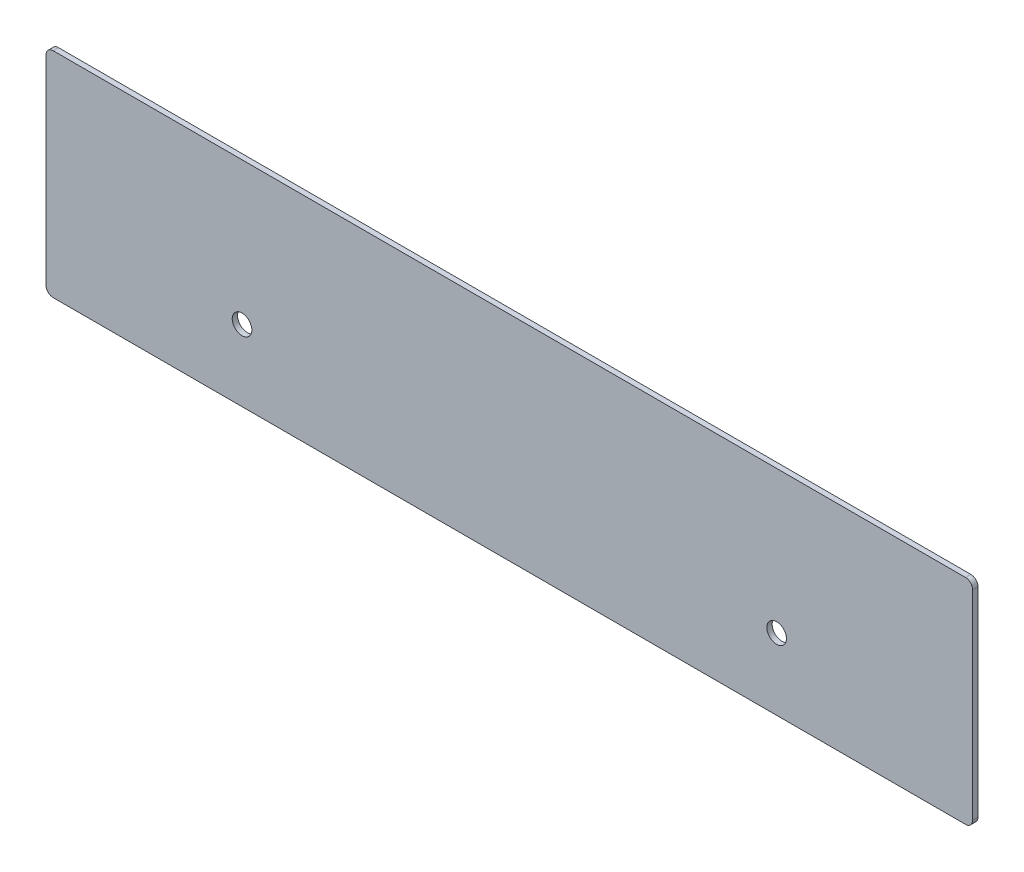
ISO-10303-21;
HEADER;
FILE_DESCRIPTION(('STEP AP214'),'2;1');
FILE_NAME('part.step','',(''),(''),'','','');
FILE_SCHEMA(('AUTOMOTIVE_DESIGN { 1 0 10303 214 1 1 1 1 }'));
ENDSEC;
DATA;
#1=APPLICATION_CONTEXT('core data for automotive mechanical design processes');
#2=APPLICATION_PROTOCOL_DEFINITION('international standard','automotive_design',2000,#1);
#3=PRODUCT_CONTEXT('',#1,'mechanical');
#4=PRODUCT('Part','Part','',(#3));
#5=PRODUCT_RELATED_PRODUCT_CATEGORY('part','',(#4));
#6=PRODUCT_DEFINITION_FORMATION('','',#4);
#7=PRODUCT_DEFINITION_CONTEXT('part definition',#1,'design');
#8=PRODUCT_DEFINITION('design','',#6,#7);
#9=PRODUCT_DEFINITION_SHAPE('','',#8);
#10=(LENGTH_UNIT() NAMED_UNIT(*) SI_UNIT(.MILLI.,.METRE.));
#11=(NAMED_UNIT(*) PLANE_ANGLE_UNIT() SI_UNIT($,.RADIAN.));
#12=(NAMED_UNIT(*) SI_UNIT($,.STERADIAN.) SOLID_ANGLE_UNIT());
#13=UNCERTAINTY_MEASURE_WITH_UNIT(LENGTH_MEASURE(1.E-05),#10,'distance_accuracy_value','');
#14=(GEOMETRIC_REPRESENTATION_CONTEXT(3) GLOBAL_UNCERTAINTY_ASSIGNED_CONTEXT((#13)) GLOBAL_UNIT_ASSIGNED_CONTEXT((#10,
#11,#12)) REPRESENTATION_CONTEXT('',''));
#15=CARTESIAN_POINT('',(0.,0.,0.));
#16=DIRECTION('',(0.,0.,1.));
#17=DIRECTION('',(1.,0.,0.));
#18=AXIS2_PLACEMENT_3D('',#15,#16,#17);
#19=CARTESIAN_POINT('',(130.,-30.,1.5));
#20=DIRECTION('',(-1.,0.,0.));
#21=DIRECTION('',(0.,0.,1.));
#22=AXIS2_PLACEMENT_3D('',#19,#20,#21);
#23=PLANE('',#22);
#24=DIRECTION('',(0.,1.,0.));
#25=VECTOR('',#24,1.);
#26=CARTESIAN_POINT('',(130.,-30.,1.5));
#27=LINE('',#26,#25);
#28=CARTESIAN_POINT('',(130.,-28.,1.5));
#29=VERTEX_POINT('',#28);
#30=CARTESIAN_POINT('',(130.,28.,1.5));
#31=VERTEX_POINT('',#30);
#32=EDGE_CURVE('E126',#29,#31,#27,.T.);
#33=ORIENTED_EDGE('',*,*,#32,.F.);
#34=DIRECTION('',(0.,0.,-1.));
#35=VECTOR('',#34,1.);
#36=CARTESIAN_POINT('',(130.,-28.,1.5));
#37=LINE('',#36,#35);
#38=CARTESIAN_POINT('',(130.,-28.,0.));
#39=VERTEX_POINT('',#38);
#40=EDGE_CURVE('E152',#29,#39,#37,.T.);
#41=ORIENTED_EDGE('',*,*,#40,.T.);
#42=DIRECTION('',(0.,1.,0.));
#43=VECTOR('',#42,1.);
#44=CARTESIAN_POINT('',(130.,-30.,0.));
#45=LINE('',#44,#43);
#46=CARTESIAN_POINT('',(130.,28.,0.));
#47=VERTEX_POINT('',#46);
#48=EDGE_CURVE('E158',#39,#47,#45,.T.);
#49=ORIENTED_EDGE('',*,*,#48,.T.);
#50=DIRECTION('',(0.,0.,-1.));
#51=VECTOR('',#50,1.);
#52=CARTESIAN_POINT('',(130.,28.,1.5));
#53=LINE('',#52,#51);
#54=EDGE_CURVE('E150',#47,#31,#53,.F.);
#55=ORIENTED_EDGE('',*,*,#54,.T.);
#56=EDGE_LOOP('',(#33,#41,#49,#55));
#57=FACE_BOUND('',#56,.T.);
#58=ADVANCED_FACE('F34',(#57),#23,.F.);
#59=CARTESIAN_POINT('',(-130.,30.,1.5));
#60=DIRECTION('',(0.,-1.,0.));
#61=DIRECTION('',(0.,0.,-1.));
#62=AXIS2_PLACEMENT_3D('',#59,#60,#61);
#63=PLANE('',#62);
#64=DIRECTION('',(-1.,0.,0.));
#65=VECTOR('',#64,1.);
#66=CARTESIAN_POINT('',(-130.,30.,1.5));
#67=LINE('',#66,#65);
#68=CARTESIAN_POINT('',(128.,30.,1.5));
#69=VERTEX_POINT('',#68);
#70=CARTESIAN_POINT('',(-128.,30.,1.5));
#71=VERTEX_POINT('',#70);
#72=EDGE_CURVE('E129',#69,#71,#67,.T.);
#73=ORIENTED_EDGE('',*,*,#72,.F.);
#74=DIRECTION('',(0.,0.,-1.));
#75=VECTOR('',#74,1.);
#76=CARTESIAN_POINT('',(128.,30.,1.5));
#77=LINE('',#76,#75);
#78=CARTESIAN_POINT('',(128.,30.,0.));
#79=VERTEX_POINT('',#78);
#80=EDGE_CURVE('E11',#69,#79,#77,.T.);
#81=ORIENTED_EDGE('',*,*,#80,.T.);
#82=DIRECTION('',(-1.,0.,0.));
#83=VECTOR('',#82,1.);
#84=CARTESIAN_POINT('',(-130.,30.,0.));
#85=LINE('',#84,#83);
#86=CARTESIAN_POINT('',(-128.,30.,0.));
#87=VERTEX_POINT('',#86);
#88=EDGE_CURVE('E131',#79,#87,#85,.T.);
#89=ORIENTED_EDGE('',*,*,#88,.T.);
#90=DIRECTION('',(0.,0.,-1.));
#91=VECTOR('',#90,1.);
#92=CARTESIAN_POINT('',(-128.,30.,1.5));
#93=LINE('',#92,#91);
#94=EDGE_CURVE('E42',#87,#71,#93,.F.);
#95=ORIENTED_EDGE('',*,*,#94,.T.);
#96=EDGE_LOOP('',(#73,#81,#89,#95));
#97=FACE_BOUND('',#96,.T.);
#98=ADVANCED_FACE('F203',(#97),#63,.F.);
#99=CARTESIAN_POINT('',(-130.,-30.,1.5));
#100=DIRECTION('',(1.,0.,0.));
#101=DIRECTION('',(0.,0.,-1.));
#102=AXIS2_PLACEMENT_3D('',#99,#100,#101);
#103=PLANE('',#102);
#104=DIRECTION('',(0.,-1.,0.));
#105=VECTOR('',#104,1.);
#106=CARTESIAN_POINT('',(-130.,-30.,0.));
#107=LINE('',#106,#105);
#108=CARTESIAN_POINT('',(-130.,28.,0.));
#109=VERTEX_POINT('',#108);
#110=CARTESIAN_POINT('',(-130.,-28.,0.));
#111=VERTEX_POINT('',#110);
#112=EDGE_CURVE('E127',#109,#111,#107,.T.);
#113=ORIENTED_EDGE('',*,*,#112,.T.);
#114=DIRECTION('',(0.,0.,-1.));
#115=VECTOR('',#114,1.);
#116=CARTESIAN_POINT('',(-130.,-28.,1.5));
#117=LINE('',#116,#115);
#118=CARTESIAN_POINT('',(-130.,-28.,1.5));
#119=VERTEX_POINT('',#118);
#120=EDGE_CURVE('E105',#111,#119,#117,.F.);
#121=ORIENTED_EDGE('',*,*,#120,.T.);
#122=DIRECTION('',(0.,-1.,0.));
#123=VECTOR('',#122,1.);
#124=CARTESIAN_POINT('',(-130.,-30.,1.5));
#125=LINE('',#124,#123);
#126=CARTESIAN_POINT('',(-130.,28.,1.5));
#127=VERTEX_POINT('',#126);
#128=EDGE_CURVE('E170',#127,#119,#125,.T.);
#129=ORIENTED_EDGE('',*,*,#128,.F.);
#130=DIRECTION('',(0.,0.,-1.));
#131=VECTOR('',#130,1.);
#132=CARTESIAN_POINT('',(-130.,28.,1.5));
#133=LINE('',#132,#131);
#134=EDGE_CURVE('E110',#127,#109,#133,.T.);
#135=ORIENTED_EDGE('',*,*,#134,.T.);
#136=EDGE_LOOP('',(#113,#121,#129,#135));
#137=FACE_BOUND('',#136,.T.);
#138=ADVANCED_FACE('F201',(#137),#103,.F.);
#139=CARTESIAN_POINT('',(-130.,-30.,1.5));
#140=DIRECTION('',(0.,1.,0.));
#141=DIRECTION('',(0.,0.,1.));
#142=AXIS2_PLACEMENT_3D('',#139,#140,#141);
#143=PLANE('',#142);
#144=DIRECTION('',(1.,0.,0.));
#145=VECTOR('',#144,1.);
#146=CARTESIAN_POINT('',(-130.,-30.,1.5));
#147=LINE('',#146,#145);
#148=CARTESIAN_POINT('',(-128.,-30.,1.5));
#149=VERTEX_POINT('',#148);
#150=CARTESIAN_POINT('',(128.,-30.,1.5));
#151=VERTEX_POINT('',#150);
#152=EDGE_CURVE('E120',#149,#151,#147,.T.);
#153=ORIENTED_EDGE('',*,*,#152,.F.);
#154=DIRECTION('',(0.,0.,-1.));
#155=VECTOR('',#154,1.);
#156=CARTESIAN_POINT('',(-128.,-30.,1.5));
#157=LINE('',#156,#155);
#158=CARTESIAN_POINT('',(-128.,-30.,0.));
#159=VERTEX_POINT('',#158);
#160=EDGE_CURVE('E104',#149,#159,#157,.T.);
#161=ORIENTED_EDGE('',*,*,#160,.T.);
#162=DIRECTION('',(1.,0.,0.));
#163=VECTOR('',#162,1.);
#164=CARTESIAN_POINT('',(-130.,-30.,0.));
#165=LINE('',#164,#163);
#166=CARTESIAN_POINT('',(128.,-30.,0.));
#167=VERTEX_POINT('',#166);
#168=EDGE_CURVE('E117',#159,#167,#165,.T.);
#169=ORIENTED_EDGE('',*,*,#168,.T.);
#170=DIRECTION('',(0.,0.,-1.));
#171=VECTOR('',#170,1.);
#172=CARTESIAN_POINT('',(128.,-30.,1.5));
#173=LINE('',#172,#171);
#174=EDGE_CURVE('E122',#167,#151,#173,.F.);
#175=ORIENTED_EDGE('',*,*,#174,.T.);
#176=EDGE_LOOP('',(#153,#161,#169,#175));
#177=FACE_BOUND('',#176,.T.);
#178=ADVANCED_FACE('F116',(#177),#143,.F.);
#179=CARTESIAN_POINT('',(0.,0.,1.5));
#180=DIRECTION('',(0.,0.,-1.));
#181=DIRECTION('',(-1.,0.,0.));
#182=AXIS2_PLACEMENT_3D('',#179,#180,#181);
#183=PLANE('',#182);
#184=CARTESIAN_POINT('',(75.,-10.,1.5));
#185=DIRECTION('',(0.,0.,1.));
#186=DIRECTION('',(1.,0.,0.));
#187=AXIS2_PLACEMENT_3D('',#184,#185,#186);
#188=CIRCLE('',#187,2.75000000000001);
#189=CARTESIAN_POINT('',(77.75,-10.,1.5));
#190=VERTEX_POINT('',#189);
#191=EDGE_CURVE('E177',#190,#190,#188,.T.);
#192=ORIENTED_EDGE('',*,*,#191,.F.);
#193=EDGE_LOOP('',(#192));
#194=FACE_BOUND('',#193,.T.);
#195=CARTESIAN_POINT('',(-75.,-9.99999999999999,1.5));
#196=DIRECTION('',(0.,0.,1.));
#197=DIRECTION('',(1.,0.,0.));
#198=AXIS2_PLACEMENT_3D('',#195,#196,#197);
#199=CIRCLE('',#198,2.75000000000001);
#200=CARTESIAN_POINT('',(-72.25,-9.99999999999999,1.5));
#201=VERTEX_POINT('',#200);
#202=EDGE_CURVE('E166',#201,#201,#199,.T.);
#203=ORIENTED_EDGE('',*,*,#202,.F.);
#204=EDGE_LOOP('',(#203));
#205=FACE_BOUND('',#204,.T.);
#206=ORIENTED_EDGE('',*,*,#128,.T.);
#207=CARTESIAN_POINT('',(-128.,-28.,1.5));
#208=DIRECTION('',(0.,0.,-1.));
#209=DIRECTION('',(-1.,0.,0.));
#210=AXIS2_PLACEMENT_3D('',#207,#208,#209);
#211=CIRCLE('',#210,2.);
#212=EDGE_CURVE('E148',#119,#149,#211,.F.);
#213=ORIENTED_EDGE('',*,*,#212,.T.);
#214=ORIENTED_EDGE('',*,*,#152,.T.);
#215=CARTESIAN_POINT('',(128.,-28.,1.5));
#216=DIRECTION('',(0.,0.,-1.));
#217=DIRECTION('',(-1.,0.,0.));
#218=AXIS2_PLACEMENT_3D('',#215,#216,#217);
#219=CIRCLE('',#218,2.);
#220=EDGE_CURVE('E146',#151,#29,#219,.F.);
#221=ORIENTED_EDGE('',*,*,#220,.T.);
#222=ORIENTED_EDGE('',*,*,#32,.T.);
#223=CARTESIAN_POINT('',(128.,28.,1.5));
#224=DIRECTION('',(0.,0.,-1.));
#225=DIRECTION('',(-1.,0.,0.));
#226=AXIS2_PLACEMENT_3D('',#223,#224,#225);
#227=CIRCLE('',#226,2.);
#228=EDGE_CURVE('E55',#31,#69,#227,.F.);
#229=ORIENTED_EDGE('',*,*,#228,.T.);
#230=ORIENTED_EDGE('',*,*,#72,.T.);
#231=CARTESIAN_POINT('',(-128.,28.,1.5));
#232=DIRECTION('',(0.,0.,-1.));
#233=DIRECTION('',(-1.,0.,0.));
#234=AXIS2_PLACEMENT_3D('',#231,#232,#233);
#235=CIRCLE('',#234,2.);
#236=EDGE_CURVE('E143',#71,#127,#235,.F.);
#237=ORIENTED_EDGE('',*,*,#236,.T.);
#238=EDGE_LOOP('',(#206,#213,#214,#221,#222,#229,#230,#237));
#239=FACE_BOUND('',#238,.T.);
#240=ADVANCED_FACE('F192',(#194,#205,#239),#183,.F.);
#241=CARTESIAN_POINT('',(0.,0.,0.));
#242=DIRECTION('',(0.,0.,-1.));
#243=DIRECTION('',(-1.,0.,0.));
#244=AXIS2_PLACEMENT_3D('',#241,#242,#243);
#245=PLANE('',#244);
#246=CARTESIAN_POINT('',(75.,-10.,0.));
#247=DIRECTION('',(0.,0.,1.));
#248=DIRECTION('',(1.,0.,0.));
#249=AXIS2_PLACEMENT_3D('',#246,#247,#248);
#250=CIRCLE('',#249,2.75000000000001);
#251=CARTESIAN_POINT('',(77.75,-10.,0.));
#252=VERTEX_POINT('',#251);
#253=EDGE_CURVE('E175',#252,#252,#250,.T.);
#254=ORIENTED_EDGE('',*,*,#253,.T.);
#255=EDGE_LOOP('',(#254));
#256=FACE_BOUND('',#255,.T.);
#257=CARTESIAN_POINT('',(-75.,-9.99999999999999,0.));
#258=DIRECTION('',(0.,0.,1.));
#259=DIRECTION('',(1.,0.,0.));
#260=AXIS2_PLACEMENT_3D('',#257,#258,#259);
#261=CIRCLE('',#260,2.75000000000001);
#262=CARTESIAN_POINT('',(-72.25,-9.99999999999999,0.));
#263=VERTEX_POINT('',#262);
#264=EDGE_CURVE('E163',#263,#263,#261,.T.);
#265=ORIENTED_EDGE('',*,*,#264,.T.);
#266=EDGE_LOOP('',(#265));
#267=FACE_BOUND('',#266,.T.);
#268=ORIENTED_EDGE('',*,*,#168,.F.);
#269=CARTESIAN_POINT('',(-128.,-28.,0.));
#270=DIRECTION('',(0.,0.,-1.));
#271=DIRECTION('',(-1.,0.,0.));
#272=AXIS2_PLACEMENT_3D('',#269,#270,#271);
#273=CIRCLE('',#272,2.);
#274=EDGE_CURVE('E100',#159,#111,#273,.T.);
#275=ORIENTED_EDGE('',*,*,#274,.T.);
#276=ORIENTED_EDGE('',*,*,#112,.F.);
#277=CARTESIAN_POINT('',(-128.,28.,0.));
#278=DIRECTION('',(0.,0.,-1.));
#279=DIRECTION('',(-1.,0.,0.));
#280=AXIS2_PLACEMENT_3D('',#277,#278,#279);
#281=CIRCLE('',#280,2.);
#282=EDGE_CURVE('E121',#109,#87,#281,.T.);
#283=ORIENTED_EDGE('',*,*,#282,.T.);
#284=ORIENTED_EDGE('',*,*,#88,.F.);
#285=CARTESIAN_POINT('',(128.,28.,0.));
#286=DIRECTION('',(0.,0.,-1.));
#287=DIRECTION('',(-1.,0.,0.));
#288=AXIS2_PLACEMENT_3D('',#285,#286,#287);
#289=CIRCLE('',#288,2.);
#290=EDGE_CURVE('E137',#79,#47,#289,.T.);
#291=ORIENTED_EDGE('',*,*,#290,.T.);
#292=ORIENTED_EDGE('',*,*,#48,.F.);
#293=CARTESIAN_POINT('',(128.,-28.,0.));
#294=DIRECTION('',(0.,0.,-1.));
#295=DIRECTION('',(-1.,0.,0.));
#296=AXIS2_PLACEMENT_3D('',#293,#294,#295);
#297=CIRCLE('',#296,2.);
#298=EDGE_CURVE('E111',#39,#167,#297,.T.);
#299=ORIENTED_EDGE('',*,*,#298,.T.);
#300=EDGE_LOOP('',(#268,#275,#276,#283,#284,#291,#292,#299));
#301=FACE_BOUND('',#300,.T.);
#302=ADVANCED_FACE('F124',(#256,#267,#301),#245,.T.);
#303=CARTESIAN_POINT('',(-75.,-9.99999999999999,0.));
#304=DIRECTION('',(0.,0.,1.));
#305=DIRECTION('',(1.,0.,0.));
#306=AXIS2_PLACEMENT_3D('',#303,#304,#305);
#307=CYLINDRICAL_SURFACE('',#306,2.75000000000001);
#308=ORIENTED_EDGE('',*,*,#264,.F.);
#309=EDGE_LOOP('',(#308));
#310=FACE_BOUND('',#309,.T.);
#311=ORIENTED_EDGE('',*,*,#202,.T.);
#312=EDGE_LOOP('',(#311));
#313=FACE_BOUND('',#312,.T.);
#314=ADVANCED_FACE('F188',(#310,#313),#307,.F.);
#315=CARTESIAN_POINT('',(75.,-10.,0.));
#316=DIRECTION('',(0.,0.,1.));
#317=DIRECTION('',(1.,0.,0.));
#318=AXIS2_PLACEMENT_3D('',#315,#316,#317);
#319=CYLINDRICAL_SURFACE('',#318,2.75000000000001);
#320=ORIENTED_EDGE('',*,*,#253,.F.);
#321=EDGE_LOOP('',(#320));
#322=FACE_BOUND('',#321,.T.);
#323=ORIENTED_EDGE('',*,*,#191,.T.);
#324=EDGE_LOOP('',(#323));
#325=FACE_BOUND('',#324,.T.);
#326=ADVANCED_FACE('F185',(#322,#325),#319,.F.);
#327=CARTESIAN_POINT('',(-128.,-28.,1.5));
#328=DIRECTION('',(0.,0.,-1.));
#329=DIRECTION('',(-1.,0.,0.));
#330=AXIS2_PLACEMENT_3D('',#327,#328,#329);
#331=CYLINDRICAL_SURFACE('',#330,2.);
#332=ORIENTED_EDGE('',*,*,#212,.F.);
#333=ORIENTED_EDGE('',*,*,#120,.F.);
#334=ORIENTED_EDGE('',*,*,#274,.F.);
#335=ORIENTED_EDGE('',*,*,#160,.F.);
#336=EDGE_LOOP('',(#332,#333,#334,#335));
#337=FACE_BOUND('',#336,.T.);
#338=ADVANCED_FACE('F103',(#337),#331,.T.);
#339=CARTESIAN_POINT('',(128.,-28.,1.5));
#340=DIRECTION('',(0.,0.,-1.));
#341=DIRECTION('',(-1.,0.,0.));
#342=AXIS2_PLACEMENT_3D('',#339,#340,#341);
#343=CYLINDRICAL_SURFACE('',#342,2.);
#344=ORIENTED_EDGE('',*,*,#220,.F.);
#345=ORIENTED_EDGE('',*,*,#174,.F.);
#346=ORIENTED_EDGE('',*,*,#298,.F.);
#347=ORIENTED_EDGE('',*,*,#40,.F.);
#348=EDGE_LOOP('',(#344,#345,#346,#347));
#349=FACE_BOUND('',#348,.T.);
#350=ADVANCED_FACE('F207',(#349),#343,.T.);
#351=CARTESIAN_POINT('',(128.,28.,1.5));
#352=DIRECTION('',(0.,0.,-1.));
#353=DIRECTION('',(-1.,0.,0.));
#354=AXIS2_PLACEMENT_3D('',#351,#352,#353);
#355=CYLINDRICAL_SURFACE('',#354,2.);
#356=ORIENTED_EDGE('',*,*,#228,.F.);
#357=ORIENTED_EDGE('',*,*,#54,.F.);
#358=ORIENTED_EDGE('',*,*,#290,.F.);
#359=ORIENTED_EDGE('',*,*,#80,.F.);
#360=EDGE_LOOP('',(#356,#357,#358,#359));
#361=FACE_BOUND('',#360,.T.);
#362=ADVANCED_FACE('F206',(#361),#355,.T.);
#363=CARTESIAN_POINT('',(-128.,28.,1.5));
#364=DIRECTION('',(0.,0.,-1.));
#365=DIRECTION('',(-1.,0.,0.));
#366=AXIS2_PLACEMENT_3D('',#363,#364,#365);
#367=CYLINDRICAL_SURFACE('',#366,2.);
#368=ORIENTED_EDGE('',*,*,#236,.F.);
#369=ORIENTED_EDGE('',*,*,#94,.F.);
#370=ORIENTED_EDGE('',*,*,#282,.F.);
#371=ORIENTED_EDGE('',*,*,#134,.F.);
#372=EDGE_LOOP('',(#368,#369,#370,#371));
#373=FACE_BOUND('',#372,.T.);
#374=ADVANCED_FACE('F36',(#373),#367,.T.);
#375=CLOSED_SHELL('',(#58,#98,#138,#178,#240,#302,#314,#326,#338,#350,#362,#374));
#376=MANIFOLD_SOLID_BREP('B2',#375);
#377=ADVANCED_BREP_SHAPE_REPRESENTATION('',(#18,#376),#14);
#378=SHAPE_DEFINITION_REPRESENTATION(#9,#377);
ENDSEC;
END-ISO-10303-21;
